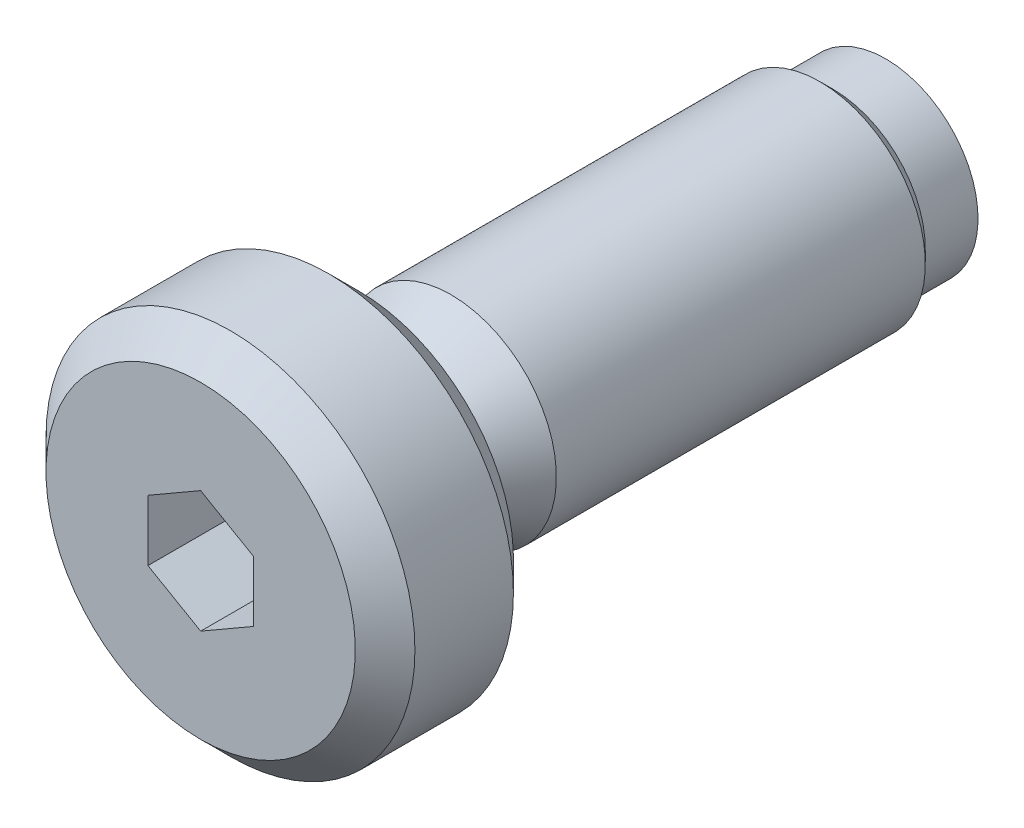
ISO-10303-21;
HEADER;
FILE_DESCRIPTION(('STEP AP214'),'2;1');
FILE_NAME('part.step','',(''),(''),'','','');
FILE_SCHEMA(('AUTOMOTIVE_DESIGN { 1 0 10303 214 1 1 1 1 }'));
ENDSEC;
DATA;
#1=APPLICATION_CONTEXT('core data for automotive mechanical design processes');
#2=APPLICATION_PROTOCOL_DEFINITION('international standard','automotive_design',2000,#1);
#3=PRODUCT_CONTEXT('',#1,'mechanical');
#4=PRODUCT('Part','Part','',(#3));
#5=PRODUCT_RELATED_PRODUCT_CATEGORY('part','',(#4));
#6=PRODUCT_DEFINITION_FORMATION('','',#4);
#7=PRODUCT_DEFINITION_CONTEXT('part definition',#1,'design');
#8=PRODUCT_DEFINITION('design','',#6,#7);
#9=PRODUCT_DEFINITION_SHAPE('','',#8);
#10=(LENGTH_UNIT() NAMED_UNIT(*) SI_UNIT(.MILLI.,.METRE.));
#11=(NAMED_UNIT(*) PLANE_ANGLE_UNIT() SI_UNIT($,.RADIAN.));
#12=(NAMED_UNIT(*) SI_UNIT($,.STERADIAN.) SOLID_ANGLE_UNIT());
#13=UNCERTAINTY_MEASURE_WITH_UNIT(LENGTH_MEASURE(1.E-05),#10,'distance_accuracy_value','');
#14=(GEOMETRIC_REPRESENTATION_CONTEXT(3) GLOBAL_UNCERTAINTY_ASSIGNED_CONTEXT((#13)) GLOBAL_UNIT_ASSIGNED_CONTEXT((#10,
#11,#12)) REPRESENTATION_CONTEXT('',''));
#15=CARTESIAN_POINT('',(0.,0.,0.));
#16=DIRECTION('',(0.,0.,1.));
#17=DIRECTION('',(1.,0.,0.));
#18=AXIS2_PLACEMENT_3D('',#15,#16,#17);
#19=CARTESIAN_POINT('',(0.,0.,13.8));
#20=DIRECTION('',(0.,0.,-1.));
#21=DIRECTION('',(0.,1.,0.));
#22=AXIS2_PLACEMENT_3D('',#19,#20,#21);
#23=PLANE('',#22);
#24=CARTESIAN_POINT('',(0.,0.,13.8));
#25=DIRECTION('',(0.,0.,-1.));
#26=DIRECTION('',(0.,1.,0.));
#27=AXIS2_PLACEMENT_3D('',#24,#25,#26);
#28=CIRCLE('',#27,2.93431457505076);
#29=CARTESIAN_POINT('',(0.,2.93431457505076,13.8));
#30=VERTEX_POINT('',#29);
#31=EDGE_CURVE('E148',#30,#30,#28,.T.);
#32=ORIENTED_EDGE('',*,*,#31,.F.);
#33=EDGE_LOOP('',(#32));
#34=FACE_BOUND('',#33,.T.);
#35=DIRECTION('',(0.866025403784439,0.5,0.));
#36=VECTOR('',#35,1.);
#37=CARTESIAN_POINT('',(0.,-1.15470053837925,13.8));
#38=LINE('',#37,#36);
#39=CARTESIAN_POINT('',(0.,-1.15470053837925,13.8));
#40=VERTEX_POINT('',#39);
#41=CARTESIAN_POINT('',(1.,-0.577350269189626,13.8));
#42=VERTEX_POINT('',#41);
#43=EDGE_CURVE('E102',#40,#42,#38,.T.);
#44=ORIENTED_EDGE('',*,*,#43,.F.);
#45=DIRECTION('',(0.866025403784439,-0.5,0.));
#46=VECTOR('',#45,1.);
#47=CARTESIAN_POINT('',(-1.,-0.577350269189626,13.8));
#48=LINE('',#47,#46);
#49=CARTESIAN_POINT('',(-1.,-0.577350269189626,13.8));
#50=VERTEX_POINT('',#49);
#51=EDGE_CURVE('E99',#50,#40,#48,.T.);
#52=ORIENTED_EDGE('',*,*,#51,.F.);
#53=DIRECTION('',(0.,-1.,0.));
#54=VECTOR('',#53,1.);
#55=CARTESIAN_POINT('',(-1.,0.577350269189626,13.8));
#56=LINE('',#55,#54);
#57=CARTESIAN_POINT('',(-1.,0.577350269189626,13.8));
#58=VERTEX_POINT('',#57);
#59=EDGE_CURVE('E97',#58,#50,#56,.T.);
#60=ORIENTED_EDGE('',*,*,#59,.F.);
#61=DIRECTION('',(-0.866025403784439,-0.5,0.));
#62=VECTOR('',#61,1.);
#63=CARTESIAN_POINT('',(0.,1.15470053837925,13.8));
#64=LINE('',#63,#62);
#65=CARTESIAN_POINT('',(0.,1.15470053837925,13.8));
#66=VERTEX_POINT('',#65);
#67=EDGE_CURVE('E106',#66,#58,#64,.T.);
#68=ORIENTED_EDGE('',*,*,#67,.F.);
#69=DIRECTION('',(-0.866025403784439,0.5,0.));
#70=VECTOR('',#69,1.);
#71=CARTESIAN_POINT('',(1.,0.577350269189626,13.8));
#72=LINE('',#71,#70);
#73=CARTESIAN_POINT('',(1.,0.577350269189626,13.8));
#74=VERTEX_POINT('',#73);
#75=EDGE_CURVE('E28',#74,#66,#72,.T.);
#76=ORIENTED_EDGE('',*,*,#75,.F.);
#77=DIRECTION('',(0.,-1.,0.));
#78=VECTOR('',#77,1.);
#79=CARTESIAN_POINT('',(1.,0.,13.8));
#80=LINE('',#79,#78);
#81=EDGE_CURVE('E21',#74,#42,#80,.T.);
#82=ORIENTED_EDGE('',*,*,#81,.T.);
#83=EDGE_LOOP('',(#44,#52,#60,#68,#76,#82));
#84=FACE_BOUND('',#83,.T.);
#85=ADVANCED_FACE('F14',(#34,#84),#23,.F.);
#86=CARTESIAN_POINT('',(0.,0.,13.8));
#87=DIRECTION('',(0.,0.,-1.));
#88=DIRECTION('',(0.,1.,0.));
#89=AXIS2_PLACEMENT_3D('',#86,#87,#88);
#90=CONICAL_SURFACE('',#89,2.93431457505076,0.785398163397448);
#91=CARTESIAN_POINT('',(0.,0.,13.2343145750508));
#92=DIRECTION('',(0.,0.,-1.));
#93=DIRECTION('',(0.,1.,0.));
#94=AXIS2_PLACEMENT_3D('',#91,#92,#93);
#95=CIRCLE('',#94,3.5);
#96=CARTESIAN_POINT('',(0.,3.5,13.2343145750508));
#97=VERTEX_POINT('',#96);
#98=EDGE_CURVE('E145',#97,#97,#95,.T.);
#99=ORIENTED_EDGE('',*,*,#98,.F.);
#100=EDGE_LOOP('',(#99));
#101=FACE_BOUND('',#100,.T.);
#102=ORIENTED_EDGE('',*,*,#31,.T.);
#103=EDGE_LOOP('',(#102));
#104=FACE_BOUND('',#103,.T.);
#105=ADVANCED_FACE('F173',(#101,#104),#90,.T.);
#106=CARTESIAN_POINT('',(0.,0.,0.8));
#107=DIRECTION('',(0.,0.,-1.));
#108=DIRECTION('',(0.,1.,0.));
#109=AXIS2_PLACEMENT_3D('',#106,#107,#108);
#110=CYLINDRICAL_SURFACE('',#109,3.5);
#111=CARTESIAN_POINT('',(0.,0.,11.3656854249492));
#112=DIRECTION('',(0.,0.,-1.));
#113=DIRECTION('',(0.,1.,0.));
#114=AXIS2_PLACEMENT_3D('',#111,#112,#113);
#115=CIRCLE('',#114,3.5);
#116=CARTESIAN_POINT('',(0.,3.5,11.3656854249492));
#117=VERTEX_POINT('',#116);
#118=EDGE_CURVE('E142',#117,#117,#115,.T.);
#119=ORIENTED_EDGE('',*,*,#118,.F.);
#120=EDGE_LOOP('',(#119));
#121=FACE_BOUND('',#120,.T.);
#122=ORIENTED_EDGE('',*,*,#98,.T.);
#123=EDGE_LOOP('',(#122));
#124=FACE_BOUND('',#123,.T.);
#125=ADVANCED_FACE('F178',(#121,#124),#110,.T.);
#126=CARTESIAN_POINT('',(0.,0.,11.3656854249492));
#127=DIRECTION('',(0.,0.,1.));
#128=DIRECTION('',(0.,-1.,0.));
#129=AXIS2_PLACEMENT_3D('',#126,#127,#128);
#130=CONICAL_SURFACE('',#129,3.5,0.785398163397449);
#131=CARTESIAN_POINT('',(0.,0.,10.8));
#132=DIRECTION('',(0.,0.,-1.));
#133=DIRECTION('',(0.,1.,0.));
#134=AXIS2_PLACEMENT_3D('',#131,#132,#133);
#135=CIRCLE('',#134,2.93431457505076);
#136=CARTESIAN_POINT('',(0.,2.93431457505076,10.8));
#137=VERTEX_POINT('',#136);
#138=EDGE_CURVE('E139',#137,#137,#135,.T.);
#139=ORIENTED_EDGE('',*,*,#138,.F.);
#140=EDGE_LOOP('',(#139));
#141=FACE_BOUND('',#140,.T.);
#142=ORIENTED_EDGE('',*,*,#118,.T.);
#143=EDGE_LOOP('',(#142));
#144=FACE_BOUND('',#143,.T.);
#145=ADVANCED_FACE('F185',(#141,#144),#130,.T.);
#146=CARTESIAN_POINT('',(2.93431457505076,0.,10.8));
#147=DIRECTION('',(0.,0.,1.));
#148=DIRECTION('',(0.,-1.,0.));
#149=AXIS2_PLACEMENT_3D('',#146,#147,#148);
#150=PLANE('',#149);
#151=CARTESIAN_POINT('',(0.,0.,10.8));
#152=DIRECTION('',(0.,0.,-1.));
#153=DIRECTION('',(0.,1.,0.));
#154=AXIS2_PLACEMENT_3D('',#151,#152,#153);
#155=CIRCLE('',#154,1.85);
#156=CARTESIAN_POINT('',(0.,1.85,10.8));
#157=VERTEX_POINT('',#156);
#158=EDGE_CURVE('E136',#157,#157,#155,.T.);
#159=ORIENTED_EDGE('',*,*,#158,.F.);
#160=EDGE_LOOP('',(#159));
#161=FACE_BOUND('',#160,.T.);
#162=ORIENTED_EDGE('',*,*,#138,.T.);
#163=EDGE_LOOP('',(#162));
#164=FACE_BOUND('',#163,.T.);
#165=ADVANCED_FACE('F192',(#161,#164),#150,.F.);
#166=CARTESIAN_POINT('',(0.,0.,10.4));
#167=DIRECTION('',(0.,0.,-1.));
#168=DIRECTION('',(0.,1.,0.));
#169=AXIS2_PLACEMENT_3D('',#166,#167,#168);
#170=TOROIDAL_SURFACE('',#169,1.85,0.4);
#171=CARTESIAN_POINT('',(0.,0.,10.4));
#172=DIRECTION('',(0.,0.,-1.));
#173=DIRECTION('',(0.,1.,0.));
#174=AXIS2_PLACEMENT_3D('',#171,#172,#173);
#175=CIRCLE('',#174,1.45);
#176=CARTESIAN_POINT('',(0.,1.45,10.4));
#177=VERTEX_POINT('',#176);
#178=EDGE_CURVE('E133',#177,#177,#175,.T.);
#179=ORIENTED_EDGE('',*,*,#178,.F.);
#180=EDGE_LOOP('',(#179));
#181=FACE_BOUND('',#180,.T.);
#182=ORIENTED_EDGE('',*,*,#158,.T.);
#183=EDGE_LOOP('',(#182));
#184=FACE_BOUND('',#183,.T.);
#185=ADVANCED_FACE('F196',(#181,#184),#170,.F.);
#186=CARTESIAN_POINT('',(0.,0.,0.8));
#187=DIRECTION('',(0.,0.,-1.));
#188=DIRECTION('',(0.,1.,0.));
#189=AXIS2_PLACEMENT_3D('',#186,#187,#188);
#190=CYLINDRICAL_SURFACE('',#189,1.45);
#191=CARTESIAN_POINT('',(0.,0.,10.1098076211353));
#192=DIRECTION('',(0.,0.,-1.));
#193=DIRECTION('',(0.,1.,0.));
#194=AXIS2_PLACEMENT_3D('',#191,#192,#193);
#195=CIRCLE('',#194,1.45);
#196=CARTESIAN_POINT('',(0.,1.45,10.1098076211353));
#197=VERTEX_POINT('',#196);
#198=EDGE_CURVE('E130',#197,#197,#195,.T.);
#199=ORIENTED_EDGE('',*,*,#198,.F.);
#200=EDGE_LOOP('',(#199));
#201=FACE_BOUND('',#200,.T.);
#202=ORIENTED_EDGE('',*,*,#178,.T.);
#203=EDGE_LOOP('',(#202));
#204=FACE_BOUND('',#203,.T.);
#205=ADVANCED_FACE('F200',(#201,#204),#190,.T.);
#206=CARTESIAN_POINT('',(0.,0.,10.1098076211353));
#207=DIRECTION('',(0.,0.,-1.));
#208=DIRECTION('',(0.,1.,0.));
#209=AXIS2_PLACEMENT_3D('',#206,#207,#208);
#210=TOROIDAL_SURFACE('',#209,1.85,0.399999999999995);
#211=CARTESIAN_POINT('',(0.,0.,9.90980762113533));
#212=DIRECTION('',(0.,0.,-1.));
#213=DIRECTION('',(0.,1.,0.));
#214=AXIS2_PLACEMENT_3D('',#211,#212,#213);
#215=CIRCLE('',#214,1.50358983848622);
#216=CARTESIAN_POINT('',(0.,1.50358983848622,9.90980762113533));
#217=VERTEX_POINT('',#216);
#218=EDGE_CURVE('E127',#217,#217,#215,.T.);
#219=ORIENTED_EDGE('',*,*,#218,.F.);
#220=EDGE_LOOP('',(#219));
#221=FACE_BOUND('',#220,.T.);
#222=ORIENTED_EDGE('',*,*,#198,.T.);
#223=EDGE_LOOP('',(#222));
#224=FACE_BOUND('',#223,.T.);
#225=ADVANCED_FACE('F204',(#221,#224),#210,.F.);
#226=CARTESIAN_POINT('',(0.,0.,9.90980762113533));
#227=DIRECTION('',(0.,0.,-1.));
#228=DIRECTION('',(0.,1.,0.));
#229=AXIS2_PLACEMENT_3D('',#226,#227,#228);
#230=CONICAL_SURFACE('',#229,1.50358983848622,0.523598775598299);
#231=CARTESIAN_POINT('',(0.,0.,9.05));
#232=DIRECTION('',(0.,0.,-1.));
#233=DIRECTION('',(0.,1.,0.));
#234=AXIS2_PLACEMENT_3D('',#231,#232,#233);
#235=CIRCLE('',#234,2.);
#236=CARTESIAN_POINT('',(0.,2.,9.05));
#237=VERTEX_POINT('',#236);
#238=EDGE_CURVE('E124',#237,#237,#235,.T.);
#239=ORIENTED_EDGE('',*,*,#238,.F.);
#240=EDGE_LOOP('',(#239));
#241=FACE_BOUND('',#240,.T.);
#242=ORIENTED_EDGE('',*,*,#218,.T.);
#243=EDGE_LOOP('',(#242));
#244=FACE_BOUND('',#243,.T.);
#245=ADVANCED_FACE('F208',(#241,#244),#230,.T.);
#246=CARTESIAN_POINT('',(0.,0.,0.8));
#247=DIRECTION('',(0.,0.,-1.));
#248=DIRECTION('',(0.,1.,0.));
#249=AXIS2_PLACEMENT_3D('',#246,#247,#248);
#250=CYLINDRICAL_SURFACE('',#249,2.);
#251=CARTESIAN_POINT('',(0.,0.,2.05));
#252=DIRECTION('',(0.,0.,-1.));
#253=DIRECTION('',(0.,1.,0.));
#254=AXIS2_PLACEMENT_3D('',#251,#252,#253);
#255=CIRCLE('',#254,2.);
#256=CARTESIAN_POINT('',(0.,2.,2.05));
#257=VERTEX_POINT('',#256);
#258=EDGE_CURVE('E121',#257,#257,#255,.T.);
#259=ORIENTED_EDGE('',*,*,#258,.F.);
#260=EDGE_LOOP('',(#259));
#261=FACE_BOUND('',#260,.T.);
#262=ORIENTED_EDGE('',*,*,#238,.T.);
#263=EDGE_LOOP('',(#262));
#264=FACE_BOUND('',#263,.T.);
#265=ADVANCED_FACE('F212',(#261,#264),#250,.T.);
#266=CARTESIAN_POINT('',(0.,0.,2.05));
#267=DIRECTION('',(0.,0.,1.));
#268=DIRECTION('',(0.,-1.,0.));
#269=AXIS2_PLACEMENT_3D('',#266,#267,#268);
#270=CONICAL_SURFACE('',#269,2.,0.785398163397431);
#271=CARTESIAN_POINT('',(0.,0.,1.8));
#272=DIRECTION('',(0.,0.,-1.));
#273=DIRECTION('',(0.,1.,0.));
#274=AXIS2_PLACEMENT_3D('',#271,#272,#273);
#275=CIRCLE('',#274,1.75);
#276=CARTESIAN_POINT('',(0.,1.75,1.8));
#277=VERTEX_POINT('',#276);
#278=EDGE_CURVE('E118',#277,#277,#275,.T.);
#279=ORIENTED_EDGE('',*,*,#278,.F.);
#280=EDGE_LOOP('',(#279));
#281=FACE_BOUND('',#280,.T.);
#282=ORIENTED_EDGE('',*,*,#258,.T.);
#283=EDGE_LOOP('',(#282));
#284=FACE_BOUND('',#283,.T.);
#285=ADVANCED_FACE('F216',(#281,#284),#270,.T.);
#286=CARTESIAN_POINT('',(0.,0.,0.8));
#287=DIRECTION('',(0.,0.,-1.));
#288=DIRECTION('',(0.,1.,0.));
#289=AXIS2_PLACEMENT_3D('',#286,#287,#288);
#290=CYLINDRICAL_SURFACE('',#289,1.75);
#291=CARTESIAN_POINT('',(0.,0.,0.8));
#292=DIRECTION('',(0.,0.,-1.));
#293=DIRECTION('',(0.,1.,0.));
#294=AXIS2_PLACEMENT_3D('',#291,#292,#293);
#295=CIRCLE('',#294,1.75);
#296=CARTESIAN_POINT('',(0.,1.75,0.8));
#297=VERTEX_POINT('',#296);
#298=EDGE_CURVE('E115',#297,#297,#295,.T.);
#299=ORIENTED_EDGE('',*,*,#298,.F.);
#300=EDGE_LOOP('',(#299));
#301=FACE_BOUND('',#300,.T.);
#302=ORIENTED_EDGE('',*,*,#278,.T.);
#303=EDGE_LOOP('',(#302));
#304=FACE_BOUND('',#303,.T.);
#305=ADVANCED_FACE('F169',(#301,#304),#290,.T.);
#306=CARTESIAN_POINT('',(1.75,0.,0.8));
#307=DIRECTION('',(0.,0.,1.));
#308=DIRECTION('',(0.,-1.,0.));
#309=AXIS2_PLACEMENT_3D('',#306,#307,#308);
#310=PLANE('',#309);
#311=CARTESIAN_POINT('',(0.,0.,0.8));
#312=DIRECTION('',(0.,0.,1.));
#313=DIRECTION('',(0.,-1.,0.));
#314=AXIS2_PLACEMENT_3D('',#311,#312,#313);
#315=CIRCLE('',#314,1.16619037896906);
#316=CARTESIAN_POINT('',(0.,-1.16619037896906,0.8));
#317=VERTEX_POINT('',#316);
#318=EDGE_CURVE('E9',#317,#317,#315,.F.);
#319=ORIENTED_EDGE('',*,*,#318,.F.);
#320=EDGE_LOOP('',(#319));
#321=FACE_BOUND('',#320,.T.);
#322=ORIENTED_EDGE('',*,*,#298,.T.);
#323=EDGE_LOOP('',(#322));
#324=FACE_BOUND('',#323,.T.);
#325=ADVANCED_FACE('F161',(#321,#324),#310,.F.);
#326=CARTESIAN_POINT('',(-1.,0.577350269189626,11.8));
#327=DIRECTION('',(-1.,0.,0.));
#328=DIRECTION('',(0.,1.,0.));
#329=AXIS2_PLACEMENT_3D('',#326,#327,#328);
#330=PLANE('',#329);
#331=ORIENTED_EDGE('',*,*,#59,.T.);
#332=DIRECTION('',(0.,0.,1.));
#333=VECTOR('',#332,1.);
#334=CARTESIAN_POINT('',(-1.,-0.577350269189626,11.8));
#335=LINE('',#334,#333);
#336=CARTESIAN_POINT('',(-1.,-0.577350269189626,11.8));
#337=VERTEX_POINT('',#336);
#338=EDGE_CURVE('E62',#337,#50,#335,.T.);
#339=ORIENTED_EDGE('',*,*,#338,.F.);
#340=DIRECTION('',(0.,-1.,0.));
#341=VECTOR('',#340,1.);
#342=CARTESIAN_POINT('',(-1.,0.577350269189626,11.8));
#343=LINE('',#342,#341);
#344=CARTESIAN_POINT('',(-1.,0.577350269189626,11.8));
#345=VERTEX_POINT('',#344);
#346=EDGE_CURVE('E108',#345,#337,#343,.T.);
#347=ORIENTED_EDGE('',*,*,#346,.F.);
#348=DIRECTION('',(0.,0.,1.));
#349=VECTOR('',#348,1.);
#350=CARTESIAN_POINT('',(-1.,0.577350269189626,11.8));
#351=LINE('',#350,#349);
#352=EDGE_CURVE('E37',#345,#58,#351,.T.);
#353=ORIENTED_EDGE('',*,*,#352,.T.);
#354=EDGE_LOOP('',(#331,#339,#347,#353));
#355=FACE_BOUND('',#354,.T.);
#356=ADVANCED_FACE('F159',(#355),#330,.F.);
#357=CARTESIAN_POINT('',(-1.,-0.577350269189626,11.8));
#358=DIRECTION('',(-0.5,-0.866025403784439,0.));
#359=DIRECTION('',(-0.866025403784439,0.5,0.));
#360=AXIS2_PLACEMENT_3D('',#357,#358,#359);
#361=PLANE('',#360);
#362=ORIENTED_EDGE('',*,*,#51,.T.);
#363=DIRECTION('',(0.,0.,1.));
#364=VECTOR('',#363,1.);
#365=CARTESIAN_POINT('',(0.,-1.15470053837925,11.8));
#366=LINE('',#365,#364);
#367=CARTESIAN_POINT('',(0.,-1.15470053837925,11.8));
#368=VERTEX_POINT('',#367);
#369=EDGE_CURVE('E112',#368,#40,#366,.T.);
#370=ORIENTED_EDGE('',*,*,#369,.F.);
#371=DIRECTION('',(0.866025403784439,-0.5,0.));
#372=VECTOR('',#371,1.);
#373=CARTESIAN_POINT('',(-1.,-0.577350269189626,11.8));
#374=LINE('',#373,#372);
#375=EDGE_CURVE('E325',#337,#368,#374,.T.);
#376=ORIENTED_EDGE('',*,*,#375,.F.);
#377=ORIENTED_EDGE('',*,*,#338,.T.);
#378=EDGE_LOOP('',(#362,#370,#376,#377));
#379=FACE_BOUND('',#378,.T.);
#380=ADVANCED_FACE('F157',(#379),#361,.F.);
#381=CARTESIAN_POINT('',(0.,-1.15470053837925,11.8));
#382=DIRECTION('',(0.5,-0.866025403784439,0.));
#383=DIRECTION('',(-0.866025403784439,-0.5,0.));
#384=AXIS2_PLACEMENT_3D('',#381,#382,#383);
#385=PLANE('',#384);
#386=ORIENTED_EDGE('',*,*,#43,.T.);
#387=DIRECTION('',(0.,0.,1.));
#388=VECTOR('',#387,1.);
#389=CARTESIAN_POINT('',(1.,-0.577350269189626,11.8));
#390=LINE('',#389,#388);
#391=CARTESIAN_POINT('',(1.,-0.577350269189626,11.8));
#392=VERTEX_POINT('',#391);
#393=EDGE_CURVE('E78',#392,#42,#390,.T.);
#394=ORIENTED_EDGE('',*,*,#393,.F.);
#395=DIRECTION('',(0.866025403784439,0.5,0.));
#396=VECTOR('',#395,1.);
#397=CARTESIAN_POINT('',(0.,-1.15470053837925,11.8));
#398=LINE('',#397,#396);
#399=EDGE_CURVE('E89',#368,#392,#398,.T.);
#400=ORIENTED_EDGE('',*,*,#399,.F.);
#401=ORIENTED_EDGE('',*,*,#369,.T.);
#402=EDGE_LOOP('',(#386,#394,#400,#401));
#403=FACE_BOUND('',#402,.T.);
#404=ADVANCED_FACE('F155',(#403),#385,.F.);
#405=CARTESIAN_POINT('',(1.,-0.577350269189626,11.8));
#406=DIRECTION('',(1.,0.,0.));
#407=DIRECTION('',(0.,-1.,0.));
#408=AXIS2_PLACEMENT_3D('',#405,#406,#407);
#409=PLANE('',#408);
#410=ORIENTED_EDGE('',*,*,#393,.T.);
#411=ORIENTED_EDGE('',*,*,#81,.F.);
#412=DIRECTION('',(0.,0.,1.));
#413=VECTOR('',#412,1.);
#414=CARTESIAN_POINT('',(1.,0.577350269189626,11.8));
#415=LINE('',#414,#413);
#416=CARTESIAN_POINT('',(1.,0.577350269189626,11.8));
#417=VERTEX_POINT('',#416);
#418=EDGE_CURVE('E72',#417,#74,#415,.T.);
#419=ORIENTED_EDGE('',*,*,#418,.F.);
#420=DIRECTION('',(0.,1.,0.));
#421=VECTOR('',#420,1.);
#422=CARTESIAN_POINT('',(1.,-0.577350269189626,11.8));
#423=LINE('',#422,#421);
#424=EDGE_CURVE('E76',#392,#417,#423,.T.);
#425=ORIENTED_EDGE('',*,*,#424,.F.);
#426=EDGE_LOOP('',(#410,#411,#419,#425));
#427=FACE_BOUND('',#426,.T.);
#428=ADVANCED_FACE('F75',(#427),#409,.F.);
#429=CARTESIAN_POINT('',(1.,0.577350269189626,11.8));
#430=DIRECTION('',(0.5,0.866025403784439,0.));
#431=DIRECTION('',(0.866025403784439,-0.5,0.));
#432=AXIS2_PLACEMENT_3D('',#429,#430,#431);
#433=PLANE('',#432);
#434=ORIENTED_EDGE('',*,*,#75,.T.);
#435=DIRECTION('',(0.,0.,1.));
#436=VECTOR('',#435,1.);
#437=CARTESIAN_POINT('',(0.,1.15470053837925,11.8));
#438=LINE('',#437,#436);
#439=CARTESIAN_POINT('',(0.,1.15470053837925,11.8));
#440=VERTEX_POINT('',#439);
#441=EDGE_CURVE('E79',#440,#66,#438,.T.);
#442=ORIENTED_EDGE('',*,*,#441,.F.);
#443=DIRECTION('',(-0.866025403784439,0.5,0.));
#444=VECTOR('',#443,1.);
#445=CARTESIAN_POINT('',(1.,0.577350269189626,11.8));
#446=LINE('',#445,#444);
#447=EDGE_CURVE('E86',#417,#440,#446,.T.);
#448=ORIENTED_EDGE('',*,*,#447,.F.);
#449=ORIENTED_EDGE('',*,*,#418,.T.);
#450=EDGE_LOOP('',(#434,#442,#448,#449));
#451=FACE_BOUND('',#450,.T.);
#452=ADVANCED_FACE('F91',(#451),#433,.F.);
#453=CARTESIAN_POINT('',(0.,1.15470053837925,11.8));
#454=DIRECTION('',(-0.5,0.866025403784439,0.));
#455=DIRECTION('',(0.866025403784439,0.5,0.));
#456=AXIS2_PLACEMENT_3D('',#453,#454,#455);
#457=PLANE('',#456);
#458=ORIENTED_EDGE('',*,*,#67,.T.);
#459=ORIENTED_EDGE('',*,*,#352,.F.);
#460=DIRECTION('',(-0.866025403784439,-0.5,0.));
#461=VECTOR('',#460,1.);
#462=CARTESIAN_POINT('',(0.,1.15470053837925,11.8));
#463=LINE('',#462,#461);
#464=EDGE_CURVE('E92',#440,#345,#463,.T.);
#465=ORIENTED_EDGE('',*,*,#464,.F.);
#466=ORIENTED_EDGE('',*,*,#441,.T.);
#467=EDGE_LOOP('',(#458,#459,#465,#466));
#468=FACE_BOUND('',#467,.T.);
#469=ADVANCED_FACE('F292',(#468),#457,.F.);
#470=CARTESIAN_POINT('',(0.,0.,11.8));
#471=DIRECTION('',(0.,0.,1.));
#472=DIRECTION('',(0.,-1.,0.));
#473=AXIS2_PLACEMENT_3D('',#470,#471,#472);
#474=PLANE('',#473);
#475=ORIENTED_EDGE('',*,*,#346,.T.);
#476=ORIENTED_EDGE('',*,*,#375,.T.);
#477=ORIENTED_EDGE('',*,*,#399,.T.);
#478=ORIENTED_EDGE('',*,*,#424,.T.);
#479=ORIENTED_EDGE('',*,*,#447,.T.);
#480=ORIENTED_EDGE('',*,*,#464,.T.);
#481=EDGE_LOOP('',(#475,#476,#477,#478,#479,#480));
#482=FACE_BOUND('',#481,.T.);
#483=ADVANCED_FACE('F85',(#482),#474,.T.);
#484=CARTESIAN_POINT('',(0.,0.,1.25));
#485=DIRECTION('',(0.,0.,1.));
#486=DIRECTION('',(0.,1.,0.));
#487=AXIS2_PLACEMENT_3D('',#484,#485,#486);
#488=SPHERICAL_SURFACE('',#487,1.25);
#489=ORIENTED_EDGE('',*,*,#318,.T.);
#490=EDGE_LOOP('',(#489));
#491=FACE_BOUND('',#490,.T.);
#492=ADVANCED_FACE('F309',(#491),#488,.T.);
#493=CLOSED_SHELL('',(#85,#105,#125,#145,#165,#185,#205,#225,#245,#265,#285,#305,#325,#356,#380,
#404,#428,#452,#469,#483,#492));
#494=MANIFOLD_SOLID_BREP('B1',#493);
#495=ADVANCED_BREP_SHAPE_REPRESENTATION('',(#18,#494),#14);
#496=SHAPE_DEFINITION_REPRESENTATION(#9,#495);
ENDSEC;
END-ISO-10303-21;
